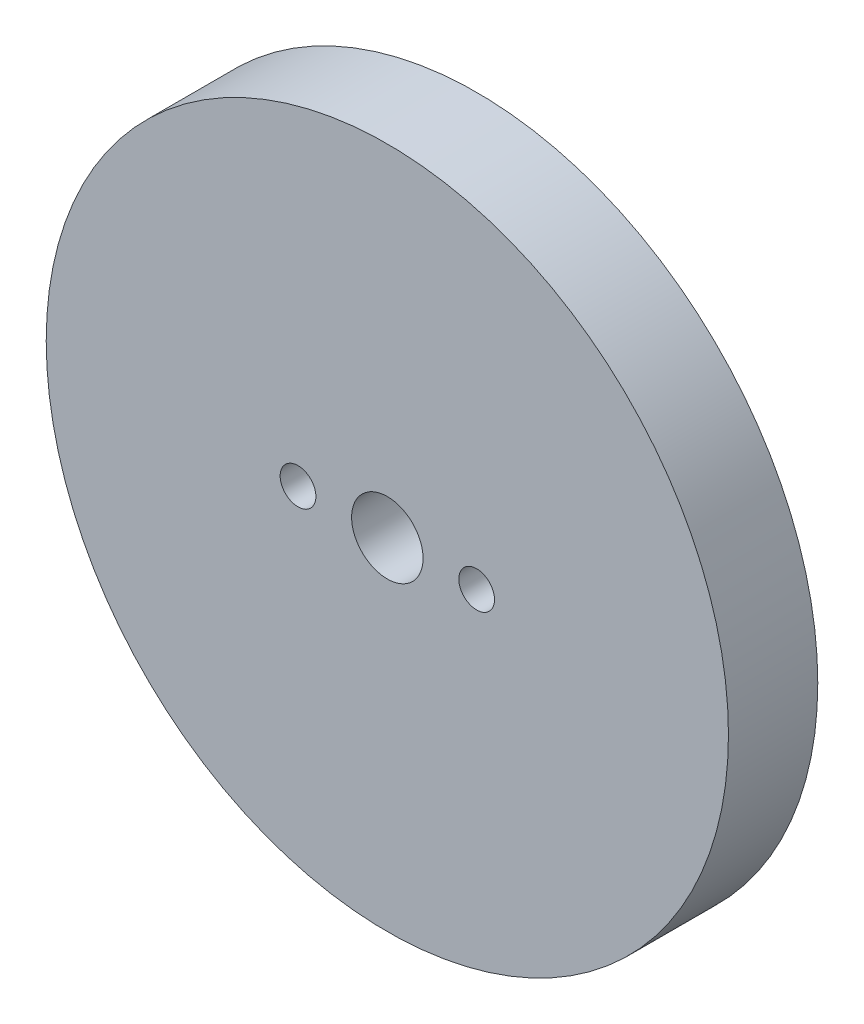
ISO-10303-21;
HEADER;
FILE_DESCRIPTION(('STEP AP214'),'2;1');
FILE_NAME('part.step','',(''),(''),'','','');
FILE_SCHEMA(('AUTOMOTIVE_DESIGN { 1 0 10303 214 1 1 1 1 }'));
ENDSEC;
DATA;
#1=APPLICATION_CONTEXT('core data for automotive mechanical design processes');
#2=APPLICATION_PROTOCOL_DEFINITION('international standard','automotive_design',2000,#1);
#3=PRODUCT_CONTEXT('',#1,'mechanical');
#4=PRODUCT('Part','Part','',(#3));
#5=PRODUCT_RELATED_PRODUCT_CATEGORY('part','',(#4));
#6=PRODUCT_DEFINITION_FORMATION('','',#4);
#7=PRODUCT_DEFINITION_CONTEXT('part definition',#1,'design');
#8=PRODUCT_DEFINITION('design','',#6,#7);
#9=PRODUCT_DEFINITION_SHAPE('','',#8);
#10=(LENGTH_UNIT() NAMED_UNIT(*) SI_UNIT(.MILLI.,.METRE.));
#11=(NAMED_UNIT(*) PLANE_ANGLE_UNIT() SI_UNIT($,.RADIAN.));
#12=(NAMED_UNIT(*) SI_UNIT($,.STERADIAN.) SOLID_ANGLE_UNIT());
#13=UNCERTAINTY_MEASURE_WITH_UNIT(LENGTH_MEASURE(1.E-05),#10,'distance_accuracy_value','');
#14=(GEOMETRIC_REPRESENTATION_CONTEXT(3) GLOBAL_UNCERTAINTY_ASSIGNED_CONTEXT((#13)) GLOBAL_UNIT_ASSIGNED_CONTEXT((#10,
#11,#12)) REPRESENTATION_CONTEXT('',''));
#15=CARTESIAN_POINT('',(0.,0.,0.));
#16=DIRECTION('',(0.,0.,1.));
#17=DIRECTION('',(1.,0.,0.));
#18=AXIS2_PLACEMENT_3D('',#15,#16,#17);
#19=CARTESIAN_POINT('',(0.,0.,5.));
#20=DIRECTION('',(0.,0.,-1.));
#21=DIRECTION('',(-1.,0.,0.));
#22=AXIS2_PLACEMENT_3D('',#19,#20,#21);
#23=CYLINDRICAL_SURFACE('',#22,19.095);
#24=CARTESIAN_POINT('',(0.,0.,5.));
#25=DIRECTION('',(0.,0.,1.));
#26=DIRECTION('',(1.,0.,0.));
#27=AXIS2_PLACEMENT_3D('',#24,#25,#26);
#28=CIRCLE('',#27,19.095);
#29=CARTESIAN_POINT('',(19.095,0.,5.));
#30=VERTEX_POINT('',#29);
#31=EDGE_CURVE('E10',#30,#30,#28,.T.);
#32=ORIENTED_EDGE('',*,*,#31,.F.);
#33=EDGE_LOOP('',(#32));
#34=FACE_BOUND('',#33,.T.);
#35=CARTESIAN_POINT('',(0.,0.,0.));
#36=DIRECTION('',(0.,0.,1.));
#37=DIRECTION('',(1.,0.,0.));
#38=AXIS2_PLACEMENT_3D('',#35,#36,#37);
#39=CIRCLE('',#38,19.095);
#40=CARTESIAN_POINT('',(19.095,0.,0.));
#41=VERTEX_POINT('',#40);
#42=EDGE_CURVE('E38',#41,#41,#39,.T.);
#43=ORIENTED_EDGE('',*,*,#42,.T.);
#44=EDGE_LOOP('',(#43));
#45=FACE_BOUND('',#44,.T.);
#46=ADVANCED_FACE('F35',(#34,#45),#23,.T.);
#47=CARTESIAN_POINT('',(0.,0.,5.));
#48=DIRECTION('',(0.,0.,1.));
#49=DIRECTION('',(1.,0.,0.));
#50=AXIS2_PLACEMENT_3D('',#47,#48,#49);
#51=PLANE('',#50);
#52=CARTESIAN_POINT('',(-5.,0.,5.));
#53=DIRECTION('',(0.,0.,1.));
#54=DIRECTION('',(1.,0.,0.));
#55=AXIS2_PLACEMENT_3D('',#52,#53,#54);
#56=CIRCLE('',#55,1.);
#57=CARTESIAN_POINT('',(-4.,0.,5.));
#58=VERTEX_POINT('',#57);
#59=EDGE_CURVE('E59',#58,#58,#56,.T.);
#60=ORIENTED_EDGE('',*,*,#59,.F.);
#61=EDGE_LOOP('',(#60));
#62=FACE_BOUND('',#61,.T.);
#63=CARTESIAN_POINT('',(5.,0.,5.));
#64=DIRECTION('',(0.,0.,1.));
#65=DIRECTION('',(1.,0.,0.));
#66=AXIS2_PLACEMENT_3D('',#63,#64,#65);
#67=CIRCLE('',#66,1.);
#68=CARTESIAN_POINT('',(6.,0.,5.));
#69=VERTEX_POINT('',#68);
#70=EDGE_CURVE('E53',#69,#69,#67,.T.);
#71=ORIENTED_EDGE('',*,*,#70,.F.);
#72=EDGE_LOOP('',(#71));
#73=FACE_BOUND('',#72,.T.);
#74=CARTESIAN_POINT('',(0.,0.,5.));
#75=DIRECTION('',(0.,0.,1.));
#76=DIRECTION('',(1.,0.,0.));
#77=AXIS2_PLACEMENT_3D('',#74,#75,#76);
#78=CIRCLE('',#77,2.);
#79=CARTESIAN_POINT('',(2.,0.,5.));
#80=VERTEX_POINT('',#79);
#81=EDGE_CURVE('E47',#80,#80,#78,.T.);
#82=ORIENTED_EDGE('',*,*,#81,.F.);
#83=EDGE_LOOP('',(#82));
#84=FACE_BOUND('',#83,.T.);
#85=ORIENTED_EDGE('',*,*,#31,.T.);
#86=EDGE_LOOP('',(#85));
#87=FACE_BOUND('',#86,.T.);
#88=ADVANCED_FACE('F75',(#62,#73,#84,#87),#51,.T.);
#89=CARTESIAN_POINT('',(0.,0.,0.));
#90=DIRECTION('',(0.,0.,1.));
#91=DIRECTION('',(1.,0.,0.));
#92=AXIS2_PLACEMENT_3D('',#89,#90,#91);
#93=PLANE('',#92);
#94=CARTESIAN_POINT('',(-5.,0.,0.));
#95=DIRECTION('',(0.,0.,1.));
#96=DIRECTION('',(1.,0.,0.));
#97=AXIS2_PLACEMENT_3D('',#94,#95,#96);
#98=CIRCLE('',#97,1.);
#99=CARTESIAN_POINT('',(-4.,0.,0.));
#100=VERTEX_POINT('',#99);
#101=EDGE_CURVE('E56',#100,#100,#98,.T.);
#102=ORIENTED_EDGE('',*,*,#101,.T.);
#103=EDGE_LOOP('',(#102));
#104=FACE_BOUND('',#103,.T.);
#105=CARTESIAN_POINT('',(5.,0.,0.));
#106=DIRECTION('',(0.,0.,1.));
#107=DIRECTION('',(1.,0.,0.));
#108=AXIS2_PLACEMENT_3D('',#105,#106,#107);
#109=CIRCLE('',#108,1.);
#110=CARTESIAN_POINT('',(6.,0.,0.));
#111=VERTEX_POINT('',#110);
#112=EDGE_CURVE('E50',#111,#111,#109,.T.);
#113=ORIENTED_EDGE('',*,*,#112,.T.);
#114=EDGE_LOOP('',(#113));
#115=FACE_BOUND('',#114,.T.);
#116=CARTESIAN_POINT('',(0.,0.,0.));
#117=DIRECTION('',(0.,0.,1.));
#118=DIRECTION('',(1.,0.,0.));
#119=AXIS2_PLACEMENT_3D('',#116,#117,#118);
#120=CIRCLE('',#119,2.);
#121=CARTESIAN_POINT('',(2.,0.,0.));
#122=VERTEX_POINT('',#121);
#123=EDGE_CURVE('E45',#122,#122,#120,.T.);
#124=ORIENTED_EDGE('',*,*,#123,.T.);
#125=EDGE_LOOP('',(#124));
#126=FACE_BOUND('',#125,.T.);
#127=ORIENTED_EDGE('',*,*,#42,.F.);
#128=EDGE_LOOP('',(#127));
#129=FACE_BOUND('',#128,.T.);
#130=ADVANCED_FACE('F65',(#104,#115,#126,#129),#93,.F.);
#131=CARTESIAN_POINT('',(0.,0.,0.));
#132=DIRECTION('',(0.,0.,1.));
#133=DIRECTION('',(1.,0.,0.));
#134=AXIS2_PLACEMENT_3D('',#131,#132,#133);
#135=CYLINDRICAL_SURFACE('',#134,2.);
#136=ORIENTED_EDGE('',*,*,#123,.F.);
#137=EDGE_LOOP('',(#136));
#138=FACE_BOUND('',#137,.T.);
#139=ORIENTED_EDGE('',*,*,#81,.T.);
#140=EDGE_LOOP('',(#139));
#141=FACE_BOUND('',#140,.T.);
#142=ADVANCED_FACE('F83',(#138,#141),#135,.F.);
#143=CARTESIAN_POINT('',(5.,0.,0.));
#144=DIRECTION('',(0.,0.,1.));
#145=DIRECTION('',(1.,0.,0.));
#146=AXIS2_PLACEMENT_3D('',#143,#144,#145);
#147=CYLINDRICAL_SURFACE('',#146,1.);
#148=ORIENTED_EDGE('',*,*,#112,.F.);
#149=EDGE_LOOP('',(#148));
#150=FACE_BOUND('',#149,.T.);
#151=ORIENTED_EDGE('',*,*,#70,.T.);
#152=EDGE_LOOP('',(#151));
#153=FACE_BOUND('',#152,.T.);
#154=ADVANCED_FACE('F71',(#150,#153),#147,.F.);
#155=CARTESIAN_POINT('',(-5.,0.,0.));
#156=DIRECTION('',(0.,0.,1.));
#157=DIRECTION('',(1.,0.,0.));
#158=AXIS2_PLACEMENT_3D('',#155,#156,#157);
#159=CYLINDRICAL_SURFACE('',#158,1.);
#160=ORIENTED_EDGE('',*,*,#101,.F.);
#161=EDGE_LOOP('',(#160));
#162=FACE_BOUND('',#161,.T.);
#163=ORIENTED_EDGE('',*,*,#59,.T.);
#164=EDGE_LOOP('',(#163));
#165=FACE_BOUND('',#164,.T.);
#166=ADVANCED_FACE('F68',(#162,#165),#159,.F.);
#167=CLOSED_SHELL('',(#46,#88,#130,#142,#154,#166));
#168=MANIFOLD_SOLID_BREP('B2',#167);
#169=ADVANCED_BREP_SHAPE_REPRESENTATION('',(#18,#168),#14);
#170=SHAPE_DEFINITION_REPRESENTATION(#9,#169);
ENDSEC;
END-ISO-10303-21;
